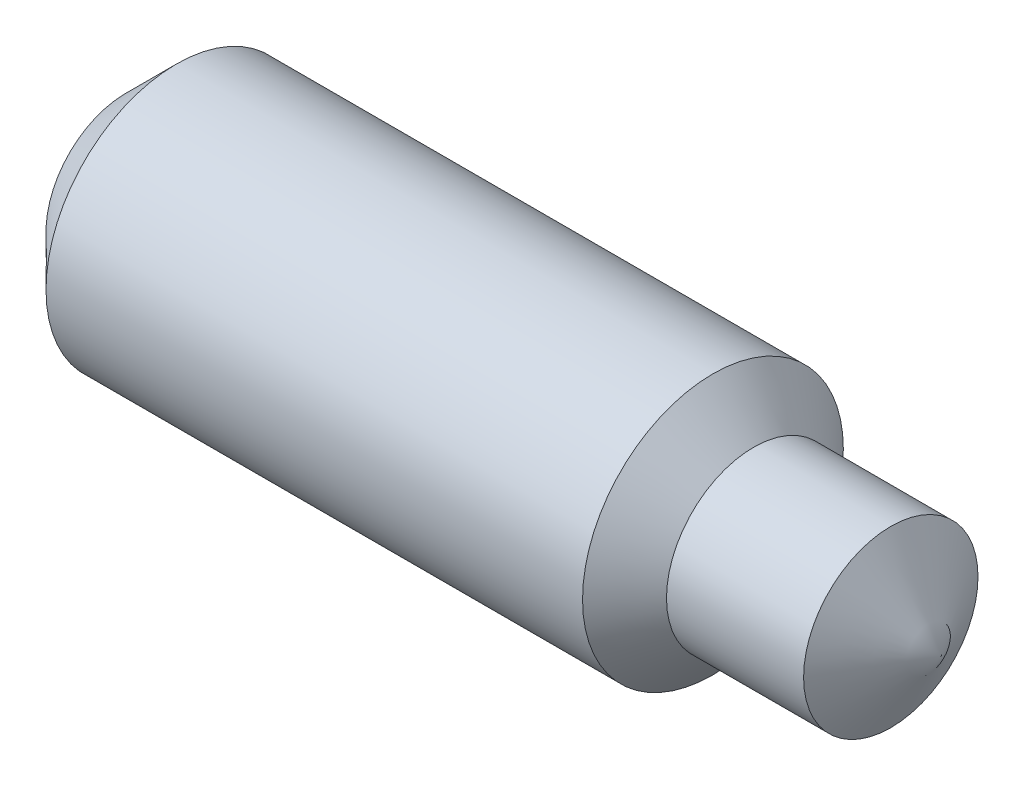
ISO-10303-21;
HEADER;
FILE_DESCRIPTION(('STEP AP214'),'2;1');
FILE_NAME('part.step','',(''),(''),'','','');
FILE_SCHEMA(('AUTOMOTIVE_DESIGN { 1 0 10303 214 1 1 1 1 }'));
ENDSEC;
DATA;
#1=APPLICATION_CONTEXT('core data for automotive mechanical design processes');
#2=APPLICATION_PROTOCOL_DEFINITION('international standard','automotive_design',2000,#1);
#3=PRODUCT_CONTEXT('',#1,'mechanical');
#4=PRODUCT('Part','Part','',(#3));
#5=PRODUCT_RELATED_PRODUCT_CATEGORY('part','',(#4));
#6=PRODUCT_DEFINITION_FORMATION('','',#4);
#7=PRODUCT_DEFINITION_CONTEXT('part definition',#1,'design');
#8=PRODUCT_DEFINITION('design','',#6,#7);
#9=PRODUCT_DEFINITION_SHAPE('','',#8);
#10=(LENGTH_UNIT() NAMED_UNIT(*) SI_UNIT(.MILLI.,.METRE.));
#11=(NAMED_UNIT(*) PLANE_ANGLE_UNIT() SI_UNIT($,.RADIAN.));
#12=(NAMED_UNIT(*) SI_UNIT($,.STERADIAN.) SOLID_ANGLE_UNIT());
#13=UNCERTAINTY_MEASURE_WITH_UNIT(LENGTH_MEASURE(1.E-05),#10,'distance_accuracy_value','');
#14=(GEOMETRIC_REPRESENTATION_CONTEXT(3) GLOBAL_UNCERTAINTY_ASSIGNED_CONTEXT((#13)) GLOBAL_UNIT_ASSIGNED_CONTEXT((#10,
#11,#12)) REPRESENTATION_CONTEXT('',''));
#15=CARTESIAN_POINT('',(0.,0.,0.));
#16=DIRECTION('',(0.,0.,1.));
#17=DIRECTION('',(1.,0.,0.));
#18=AXIS2_PLACEMENT_3D('',#15,#16,#17);
#19=CARTESIAN_POINT('',(-1.32840536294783,0.,0.));
#20=DIRECTION('',(-1.,0.,0.));
#21=DIRECTION('',(0.,0.,1.));
#22=AXIS2_PLACEMENT_3D('',#19,#20,#21);
#23=CYLINDRICAL_SURFACE('',#22,2.675);
#24=CARTESIAN_POINT('',(23.4555880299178,0.,0.));
#25=DIRECTION('',(1.,0.,0.));
#26=DIRECTION('',(0.,0.,-1.));
#27=AXIS2_PLACEMENT_3D('',#24,#25,#26);
#28=CIRCLE('',#27,2.675);
#29=CARTESIAN_POINT('',(23.4555880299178,0.,-2.675));
#30=VERTEX_POINT('',#29);
#31=EDGE_CURVE('E53',#30,#30,#28,.T.);
#32=ORIENTED_EDGE('',*,*,#31,.F.);
#33=EDGE_LOOP('',(#32));
#34=FACE_BOUND('',#33,.T.);
#35=CARTESIAN_POINT('',(19.25,0.,0.));
#36=DIRECTION('',(-1.,0.,0.));
#37=DIRECTION('',(0.,0.,1.));
#38=AXIS2_PLACEMENT_3D('',#35,#36,#37);
#39=CIRCLE('',#38,2.675);
#40=CARTESIAN_POINT('',(19.25,0.,2.675));
#41=VERTEX_POINT('',#40);
#42=EDGE_CURVE('E58',#41,#41,#39,.T.);
#43=ORIENTED_EDGE('',*,*,#42,.F.);
#44=EDGE_LOOP('',(#43));
#45=FACE_BOUND('',#44,.T.);
#46=ADVANCED_FACE('F37',(#34,#45),#23,.T.);
#47=CARTESIAN_POINT('',(19.25,0.,0.));
#48=DIRECTION('',(-1.,0.,0.));
#49=DIRECTION('',(0.,0.,1.));
#50=AXIS2_PLACEMENT_3D('',#47,#48,#49);
#51=CONICAL_SURFACE('',#50,2.675,0.814516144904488);
#52=CARTESIAN_POINT('',(18.,0.,0.));
#53=DIRECTION('',(-1.,0.,0.));
#54=DIRECTION('',(0.,0.,1.));
#55=AXIS2_PLACEMENT_3D('',#52,#53,#54);
#56=CIRCLE('',#55,4.);
#57=CARTESIAN_POINT('',(18.,0.,4.));
#58=VERTEX_POINT('',#57);
#59=EDGE_CURVE('E55',#58,#58,#56,.T.);
#60=ORIENTED_EDGE('',*,*,#59,.F.);
#61=EDGE_LOOP('',(#60));
#62=FACE_BOUND('',#61,.T.);
#63=ORIENTED_EDGE('',*,*,#42,.T.);
#64=EDGE_LOOP('',(#63));
#65=FACE_BOUND('',#64,.T.);
#66=ADVANCED_FACE('F76',(#62,#65),#51,.T.);
#67=CARTESIAN_POINT('',(-1.32840536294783,0.,0.));
#68=DIRECTION('',(-1.,0.,0.));
#69=DIRECTION('',(0.,0.,1.));
#70=AXIS2_PLACEMENT_3D('',#67,#68,#69);
#71=CYLINDRICAL_SURFACE('',#70,4.);
#72=CARTESIAN_POINT('',(1.54150000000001,0.,0.));
#73=DIRECTION('',(1.,0.,0.));
#74=DIRECTION('',(0.,0.,-1.));
#75=AXIS2_PLACEMENT_3D('',#72,#73,#74);
#76=CIRCLE('',#75,4.);
#77=CARTESIAN_POINT('',(1.54150000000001,0.,-4.));
#78=VERTEX_POINT('',#77);
#79=EDGE_CURVE('E11',#78,#78,#76,.T.);
#80=ORIENTED_EDGE('',*,*,#79,.T.);
#81=EDGE_LOOP('',(#80));
#82=FACE_BOUND('',#81,.T.);
#83=ORIENTED_EDGE('',*,*,#59,.T.);
#84=EDGE_LOOP('',(#83));
#85=FACE_BOUND('',#84,.T.);
#86=ADVANCED_FACE('F72',(#82,#85),#71,.T.);
#87=CARTESIAN_POINT('',(0.,0.,0.));
#88=DIRECTION('',(1.,0.,0.));
#89=DIRECTION('',(0.,0.,-1.));
#90=AXIS2_PLACEMENT_3D('',#87,#88,#89);
#91=PLANE('',#90);
#92=CARTESIAN_POINT('',(0.,0.,0.));
#93=DIRECTION('',(1.,0.,0.));
#94=DIRECTION('',(0.,0.,-1.));
#95=AXIS2_PLACEMENT_3D('',#92,#93,#94);
#96=CIRCLE('',#95,2.4585);
#97=CARTESIAN_POINT('',(0.,0.,-2.4585));
#98=VERTEX_POINT('',#97);
#99=EDGE_CURVE('E44',#98,#98,#96,.F.);
#100=ORIENTED_EDGE('',*,*,#99,.T.);
#101=EDGE_LOOP('',(#100));
#102=FACE_BOUND('',#101,.T.);
#103=ADVANCED_FACE('F65',(#102),#91,.F.);
#104=CARTESIAN_POINT('',(0.,0.,0.));
#105=DIRECTION('',(1.,0.,0.));
#106=DIRECTION('',(0.,0.,-1.));
#107=AXIS2_PLACEMENT_3D('',#104,#105,#106);
#108=CONICAL_SURFACE('',#107,2.4585,0.785398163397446);
#109=ORIENTED_EDGE('',*,*,#79,.F.);
#110=EDGE_LOOP('',(#109));
#111=FACE_BOUND('',#110,.T.);
#112=ORIENTED_EDGE('',*,*,#99,.F.);
#113=EDGE_LOOP('',(#112));
#114=FACE_BOUND('',#113,.T.);
#115=ADVANCED_FACE('F39',(#111,#114),#108,.T.);
#116=CARTESIAN_POINT('',(23.4555880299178,0.,0.));
#117=DIRECTION('',(-1.,0.,0.));
#118=DIRECTION('',(0.,0.,1.));
#119=AXIS2_PLACEMENT_3D('',#116,#117,#118);
#120=CONICAL_SURFACE('',#119,2.675,1.0471975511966);
#121=CARTESIAN_POINT('',(25.,0.,0.));
#122=VERTEX_POINT('',#121);
#123=VERTEX_LOOP('',#122);
#124=FACE_BOUND('',#123,.T.);
#125=ORIENTED_EDGE('',*,*,#31,.T.);
#126=EDGE_LOOP('',(#125));
#127=FACE_BOUND('',#126,.T.);
#128=ADVANCED_FACE('F47',(#124,#127),#120,.T.);
#129=CLOSED_SHELL('',(#46,#66,#86,#103,#115,#128));
#130=MANIFOLD_SOLID_BREP('B2',#129);
#131=ADVANCED_BREP_SHAPE_REPRESENTATION('',(#18,#130),#14);
#132=SHAPE_DEFINITION_REPRESENTATION(#9,#131);
ENDSEC;
END-ISO-10303-21;
